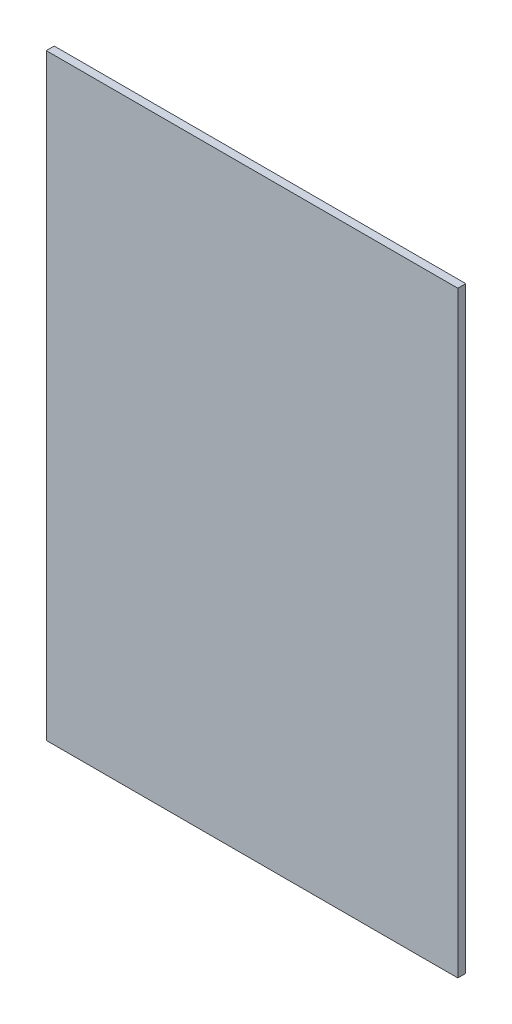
ISO-10303-21;
HEADER;
FILE_DESCRIPTION(('STEP AP214'),'2;1');
FILE_NAME('part.step','',(''),(''),'','','');
FILE_SCHEMA(('AUTOMOTIVE_DESIGN { 1 0 10303 214 1 1 1 1 }'));
ENDSEC;
DATA;
#1=APPLICATION_CONTEXT('core data for automotive mechanical design processes');
#2=APPLICATION_PROTOCOL_DEFINITION('international standard','automotive_design',2000,#1);
#3=PRODUCT_CONTEXT('',#1,'mechanical');
#4=PRODUCT('Part','Part','',(#3));
#5=PRODUCT_RELATED_PRODUCT_CATEGORY('part','',(#4));
#6=PRODUCT_DEFINITION_FORMATION('','',#4);
#7=PRODUCT_DEFINITION_CONTEXT('part definition',#1,'design');
#8=PRODUCT_DEFINITION('design','',#6,#7);
#9=PRODUCT_DEFINITION_SHAPE('','',#8);
#10=(LENGTH_UNIT() NAMED_UNIT(*) SI_UNIT(.MILLI.,.METRE.));
#11=(NAMED_UNIT(*) PLANE_ANGLE_UNIT() SI_UNIT($,.RADIAN.));
#12=(NAMED_UNIT(*) SI_UNIT($,.STERADIAN.) SOLID_ANGLE_UNIT());
#13=UNCERTAINTY_MEASURE_WITH_UNIT(LENGTH_MEASURE(1.E-05),#10,'distance_accuracy_value','');
#14=(GEOMETRIC_REPRESENTATION_CONTEXT(3) GLOBAL_UNCERTAINTY_ASSIGNED_CONTEXT((#13)) GLOBAL_UNIT_ASSIGNED_CONTEXT((#10,
#11,#12)) REPRESENTATION_CONTEXT('',''));
#15=CARTESIAN_POINT('',(0.,0.,0.));
#16=DIRECTION('',(0.,0.,1.));
#17=DIRECTION('',(1.,0.,0.));
#18=AXIS2_PLACEMENT_3D('',#15,#16,#17);
#19=CARTESIAN_POINT('',(0.,0.,6.));
#20=DIRECTION('',(0.,0.,1.));
#21=DIRECTION('',(1.,0.,0.));
#22=AXIS2_PLACEMENT_3D('',#19,#20,#21);
#23=PLANE('',#22);
#24=DIRECTION('',(1.,0.,0.));
#25=VECTOR('',#24,1.);
#26=CARTESIAN_POINT('',(-155.,-225.,6.));
#27=LINE('',#26,#25);
#28=CARTESIAN_POINT('',(-155.,-225.,6.));
#29=VERTEX_POINT('',#28);
#30=CARTESIAN_POINT('',(155.,-225.,6.));
#31=VERTEX_POINT('',#30);
#32=EDGE_CURVE('E91',#29,#31,#27,.T.);
#33=ORIENTED_EDGE('',*,*,#32,.T.);
#34=DIRECTION('',(0.,1.,0.));
#35=VECTOR('',#34,1.);
#36=CARTESIAN_POINT('',(155.,-225.,6.));
#37=LINE('',#36,#35);
#38=CARTESIAN_POINT('',(155.,225.,6.));
#39=VERTEX_POINT('',#38);
#40=EDGE_CURVE('E70',#31,#39,#37,.T.);
#41=ORIENTED_EDGE('',*,*,#40,.T.);
#42=DIRECTION('',(-1.,0.,0.));
#43=VECTOR('',#42,1.);
#44=CARTESIAN_POINT('',(155.,225.,6.));
#45=LINE('',#44,#43);
#46=CARTESIAN_POINT('',(-155.,225.,6.));
#47=VERTEX_POINT('',#46);
#48=EDGE_CURVE('E75',#39,#47,#45,.T.);
#49=ORIENTED_EDGE('',*,*,#48,.T.);
#50=DIRECTION('',(0.,-1.,0.));
#51=VECTOR('',#50,1.);
#52=CARTESIAN_POINT('',(-155.,225.,6.));
#53=LINE('',#52,#51);
#54=EDGE_CURVE('E10',#47,#29,#53,.T.);
#55=ORIENTED_EDGE('',*,*,#54,.T.);
#56=EDGE_LOOP('',(#33,#41,#49,#55));
#57=FACE_BOUND('',#56,.T.);
#58=ADVANCED_FACE('F16',(#57),#23,.T.);
#59=CARTESIAN_POINT('',(0.,0.,0.));
#60=DIRECTION('',(0.,0.,1.));
#61=DIRECTION('',(1.,0.,0.));
#62=AXIS2_PLACEMENT_3D('',#59,#60,#61);
#63=PLANE('',#62);
#64=DIRECTION('',(0.,-1.,0.));
#65=VECTOR('',#64,1.);
#66=CARTESIAN_POINT('',(-155.,225.,0.));
#67=LINE('',#66,#65);
#68=CARTESIAN_POINT('',(-155.,225.,0.));
#69=VERTEX_POINT('',#68);
#70=CARTESIAN_POINT('',(-155.,-225.,0.));
#71=VERTEX_POINT('',#70);
#72=EDGE_CURVE('E24',#69,#71,#67,.T.);
#73=ORIENTED_EDGE('',*,*,#72,.F.);
#74=DIRECTION('',(-1.,0.,0.));
#75=VECTOR('',#74,1.);
#76=CARTESIAN_POINT('',(155.,225.,0.));
#77=LINE('',#76,#75);
#78=CARTESIAN_POINT('',(155.,225.,0.));
#79=VERTEX_POINT('',#78);
#80=EDGE_CURVE('E59',#79,#69,#77,.T.);
#81=ORIENTED_EDGE('',*,*,#80,.F.);
#82=DIRECTION('',(0.,1.,0.));
#83=VECTOR('',#82,1.);
#84=CARTESIAN_POINT('',(155.,-225.,0.));
#85=LINE('',#84,#83);
#86=CARTESIAN_POINT('',(155.,-225.,0.));
#87=VERTEX_POINT('',#86);
#88=EDGE_CURVE('E64',#87,#79,#85,.T.);
#89=ORIENTED_EDGE('',*,*,#88,.F.);
#90=DIRECTION('',(1.,0.,0.));
#91=VECTOR('',#90,1.);
#92=CARTESIAN_POINT('',(-155.,-225.,0.));
#93=LINE('',#92,#91);
#94=EDGE_CURVE('E105',#71,#87,#93,.T.);
#95=ORIENTED_EDGE('',*,*,#94,.F.);
#96=EDGE_LOOP('',(#73,#81,#89,#95));
#97=FACE_BOUND('',#96,.T.);
#98=ADVANCED_FACE('F61',(#97),#63,.F.);
#99=CARTESIAN_POINT('',(-155.,225.,0.));
#100=DIRECTION('',(1.,0.,0.));
#101=DIRECTION('',(0.,1.,0.));
#102=AXIS2_PLACEMENT_3D('',#99,#100,#101);
#103=PLANE('',#102);
#104=ORIENTED_EDGE('',*,*,#72,.T.);
#105=DIRECTION('',(0.,0.,1.));
#106=VECTOR('',#105,1.);
#107=CARTESIAN_POINT('',(-155.,-225.,0.));
#108=LINE('',#107,#106);
#109=EDGE_CURVE('E86',#71,#29,#108,.T.);
#110=ORIENTED_EDGE('',*,*,#109,.T.);
#111=ORIENTED_EDGE('',*,*,#54,.F.);
#112=DIRECTION('',(0.,0.,1.));
#113=VECTOR('',#112,1.);
#114=CARTESIAN_POINT('',(-155.,225.,0.));
#115=LINE('',#114,#113);
#116=EDGE_CURVE('E69',#69,#47,#115,.T.);
#117=ORIENTED_EDGE('',*,*,#116,.F.);
#118=EDGE_LOOP('',(#104,#110,#111,#117));
#119=FACE_BOUND('',#118,.T.);
#120=ADVANCED_FACE('F134',(#119),#103,.F.);
#121=CARTESIAN_POINT('',(155.,225.,0.));
#122=DIRECTION('',(0.,-1.,0.));
#123=DIRECTION('',(0.,0.,-1.));
#124=AXIS2_PLACEMENT_3D('',#121,#122,#123);
#125=PLANE('',#124);
#126=ORIENTED_EDGE('',*,*,#80,.T.);
#127=ORIENTED_EDGE('',*,*,#116,.T.);
#128=ORIENTED_EDGE('',*,*,#48,.F.);
#129=DIRECTION('',(0.,0.,1.));
#130=VECTOR('',#129,1.);
#131=CARTESIAN_POINT('',(155.,225.,0.));
#132=LINE('',#131,#130);
#133=EDGE_CURVE('E73',#79,#39,#132,.T.);
#134=ORIENTED_EDGE('',*,*,#133,.F.);
#135=EDGE_LOOP('',(#126,#127,#128,#134));
#136=FACE_BOUND('',#135,.T.);
#137=ADVANCED_FACE('F74',(#136),#125,.F.);
#138=CARTESIAN_POINT('',(155.,-225.,0.));
#139=DIRECTION('',(-1.,0.,0.));
#140=DIRECTION('',(0.,0.,1.));
#141=AXIS2_PLACEMENT_3D('',#138,#139,#140);
#142=PLANE('',#141);
#143=ORIENTED_EDGE('',*,*,#88,.T.);
#144=ORIENTED_EDGE('',*,*,#133,.T.);
#145=ORIENTED_EDGE('',*,*,#40,.F.);
#146=DIRECTION('',(0.,0.,1.));
#147=VECTOR('',#146,1.);
#148=CARTESIAN_POINT('',(155.,-225.,0.));
#149=LINE('',#148,#147);
#150=EDGE_CURVE('E83',#87,#31,#149,.T.);
#151=ORIENTED_EDGE('',*,*,#150,.F.);
#152=EDGE_LOOP('',(#143,#144,#145,#151));
#153=FACE_BOUND('',#152,.T.);
#154=ADVANCED_FACE('F81',(#153),#142,.F.);
#155=CARTESIAN_POINT('',(-155.,-225.,0.));
#156=DIRECTION('',(0.,1.,0.));
#157=DIRECTION('',(1.,0.,0.));
#158=AXIS2_PLACEMENT_3D('',#155,#156,#157);
#159=PLANE('',#158);
#160=ORIENTED_EDGE('',*,*,#94,.T.);
#161=ORIENTED_EDGE('',*,*,#150,.T.);
#162=ORIENTED_EDGE('',*,*,#32,.F.);
#163=ORIENTED_EDGE('',*,*,#109,.F.);
#164=EDGE_LOOP('',(#160,#161,#162,#163));
#165=FACE_BOUND('',#164,.T.);
#166=ADVANCED_FACE('F149',(#165),#159,.F.);
#167=CLOSED_SHELL('',(#58,#98,#120,#137,#154,#166));
#168=MANIFOLD_SOLID_BREP('B1',#167);
#169=ADVANCED_BREP_SHAPE_REPRESENTATION('',(#18,#168),#14);
#170=SHAPE_DEFINITION_REPRESENTATION(#9,#169);
ENDSEC;
END-ISO-10303-21;
